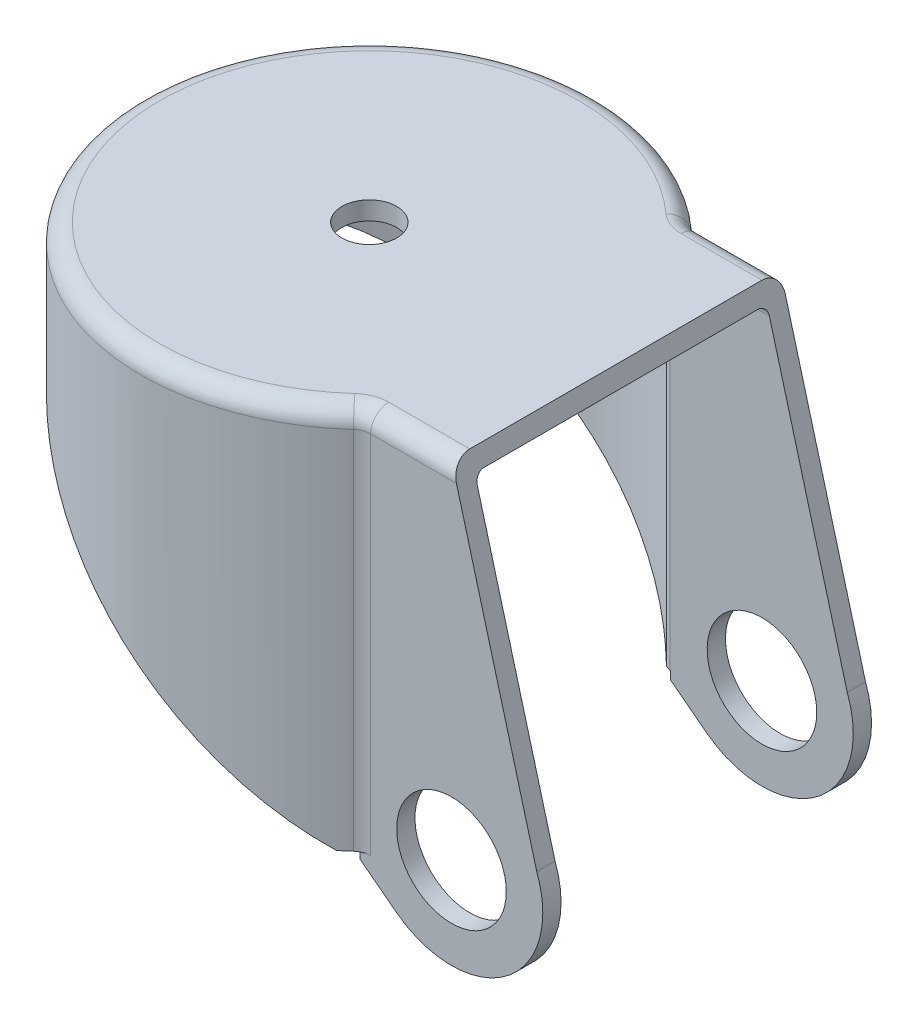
ISO-10303-21;
HEADER;
FILE_DESCRIPTION(('STEP AP214'),'2;1');
FILE_NAME('part.step','',(''),(''),'','','');
FILE_SCHEMA(('AUTOMOTIVE_DESIGN { 1 0 10303 214 1 1 1 1 }'));
ENDSEC;
DATA;
#1=APPLICATION_CONTEXT('core data for automotive mechanical design processes');
#2=APPLICATION_PROTOCOL_DEFINITION('international standard','automotive_design',2000,#1);
#3=PRODUCT_CONTEXT('',#1,'mechanical');
#4=PRODUCT('Part','Part','',(#3));
#5=PRODUCT_RELATED_PRODUCT_CATEGORY('part','',(#4));
#6=PRODUCT_DEFINITION_FORMATION('','',#4);
#7=PRODUCT_DEFINITION_CONTEXT('part definition',#1,'design');
#8=PRODUCT_DEFINITION('design','',#6,#7);
#9=PRODUCT_DEFINITION_SHAPE('','',#8);
#10=(LENGTH_UNIT() NAMED_UNIT(*) SI_UNIT(.MILLI.,.METRE.));
#11=(NAMED_UNIT(*) PLANE_ANGLE_UNIT() SI_UNIT($,.RADIAN.));
#12=(NAMED_UNIT(*) SI_UNIT($,.STERADIAN.) SOLID_ANGLE_UNIT());
#13=UNCERTAINTY_MEASURE_WITH_UNIT(LENGTH_MEASURE(1.E-05),#10,'distance_accuracy_value','');
#14=(GEOMETRIC_REPRESENTATION_CONTEXT(3) GLOBAL_UNCERTAINTY_ASSIGNED_CONTEXT((#13)) GLOBAL_UNIT_ASSIGNED_CONTEXT((#10,
#11,#12)) REPRESENTATION_CONTEXT('',''));
#15=CARTESIAN_POINT('',(0.,0.,0.));
#16=DIRECTION('',(0.,0.,1.));
#17=DIRECTION('',(1.,0.,0.));
#18=AXIS2_PLACEMENT_3D('',#15,#16,#17);
#19=CARTESIAN_POINT('',(-13.5,-2.,0.));
#20=DIRECTION('',(0.,1.,0.));
#21=DIRECTION('',(0.,0.,1.));
#22=AXIS2_PLACEMENT_3D('',#19,#20,#21);
#23=CYLINDRICAL_SURFACE('',#22,11.5);
#24=CARTESIAN_POINT('',(-13.5,-2.,0.));
#25=DIRECTION('',(0.,1.,0.));
#26=DIRECTION('',(0.,0.,-1.));
#27=AXIS2_PLACEMENT_3D('',#24,#25,#26);
#28=CIRCLE('',#27,11.5);
#29=CARTESIAN_POINT('',(-5.38240187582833,-2.,-8.14583333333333));
#30=VERTEX_POINT('',#29);
#31=CARTESIAN_POINT('',(-5.60694741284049,-2.,-8.3635949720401));
#32=VERTEX_POINT('',#31);
#33=EDGE_CURVE('E414',#30,#32,#28,.T.);
#34=ORIENTED_EDGE('',*,*,#33,.F.);
#35=DIRECTION('',(0.,1.,0.));
#36=VECTOR('',#35,1.);
#37=CARTESIAN_POINT('',(-5.38240187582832,-2.,-8.14583333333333));
#38=LINE('',#37,#36);
#39=CARTESIAN_POINT('',(-5.38240187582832,17.5,-8.14583333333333));
#40=VERTEX_POINT('',#39);
#41=EDGE_CURVE('E338',#30,#40,#38,.T.);
#42=ORIENTED_EDGE('',*,*,#41,.T.);
#43=CARTESIAN_POINT('',(-13.5,17.5,0.));
#44=DIRECTION('',(0.,-1.,0.));
#45=DIRECTION('',(0.,0.,-1.));
#46=AXIS2_PLACEMENT_3D('',#43,#44,#45);
#47=CIRCLE('',#46,11.5);
#48=CARTESIAN_POINT('',(-5.38240187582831,17.5,8.14583333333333));
#49=VERTEX_POINT('',#48);
#50=EDGE_CURVE('E334',#40,#49,#47,.F.);
#51=ORIENTED_EDGE('',*,*,#50,.T.);
#52=DIRECTION('',(0.,1.,0.));
#53=VECTOR('',#52,1.);
#54=CARTESIAN_POINT('',(-5.38240187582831,-2.,8.14583333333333));
#55=LINE('',#54,#53);
#56=CARTESIAN_POINT('',(-5.38240187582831,-2.,8.14583333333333));
#57=VERTEX_POINT('',#56);
#58=EDGE_CURVE('E336',#49,#57,#55,.F.);
#59=ORIENTED_EDGE('',*,*,#58,.T.);
#60=CARTESIAN_POINT('',(-5.60694741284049,-2.,8.36359497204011));
#61=VERTEX_POINT('',#60);
#62=EDGE_CURVE('E413',#61,#57,#28,.T.);
#63=ORIENTED_EDGE('',*,*,#62,.F.);
#64=CARTESIAN_POINT('',(-13.5,4.05655226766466,0.));
#65=DIRECTION('',(-0.608761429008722,-0.793353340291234,0.));
#66=DIRECTION('',(-0.793353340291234,0.608761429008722,0.));
#67=AXIS2_PLACEMENT_3D('',#64,#65,#66);
#68=ELLIPSE('',#67,14.4954327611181,11.5);
#69=EDGE_CURVE('E406',#32,#61,#68,.F.);
#70=ORIENTED_EDGE('',*,*,#69,.F.);
#71=EDGE_LOOP('',(#34,#42,#51,#59,#63,#70));
#72=FACE_BOUND('',#71,.T.);
#73=ADVANCED_FACE('F35',(#72),#23,.F.);
#74=CARTESIAN_POINT('',(-13.5,-2.,0.));
#75=DIRECTION('',(0.,-1.,0.));
#76=DIRECTION('',(0.,0.,-1.));
#77=AXIS2_PLACEMENT_3D('',#74,#75,#76);
#78=PLANE('',#77);
#79=ORIENTED_EDGE('',*,*,#62,.T.);
#80=CARTESIAN_POINT('',(-5.02946282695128,-2.,8.49999999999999));
#81=DIRECTION('',(0.,-1.,0.));
#82=DIRECTION('',(0.,0.,-1.));
#83=AXIS2_PLACEMENT_3D('',#80,#81,#82);
#84=CIRCLE('',#83,0.5);
#85=CARTESIAN_POINT('',(-5.02946282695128,-2.,8.));
#86=VERTEX_POINT('',#85);
#87=EDGE_CURVE('E215',#57,#86,#84,.T.);
#88=ORIENTED_EDGE('',*,*,#87,.T.);
#89=DIRECTION('',(-1.,0.,0.));
#90=VECTOR('',#89,1.);
#91=CARTESIAN_POINT('',(-3.04380714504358,-2.,8.));
#92=LINE('',#91,#90);
#93=CARTESIAN_POINT('',(-5.,-2.,8.));
#94=VERTEX_POINT('',#93);
#95=EDGE_CURVE('E208',#94,#86,#92,.T.);
#96=ORIENTED_EDGE('',*,*,#95,.F.);
#97=DIRECTION('',(0.,0.,-1.));
#98=VECTOR('',#97,1.);
#99=CARTESIAN_POINT('',(-5.,-2.,-9.));
#100=LINE('',#99,#98);
#101=CARTESIAN_POINT('',(-5.,-2.,9.));
#102=VERTEX_POINT('',#101);
#103=EDGE_CURVE('E212',#102,#94,#100,.T.);
#104=ORIENTED_EDGE('',*,*,#103,.F.);
#105=DIRECTION('',(-1.,0.,0.));
#106=VECTOR('',#105,1.);
#107=CARTESIAN_POINT('',(-26.,-2.,9.));
#108=LINE('',#107,#106);
#109=CARTESIAN_POINT('',(-4.43082142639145,-2.,9.));
#110=VERTEX_POINT('',#109);
#111=EDGE_CURVE('E419',#110,#102,#108,.T.);
#112=ORIENTED_EDGE('',*,*,#111,.F.);
#113=CARTESIAN_POINT('',(-4.43082142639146,-2.,9.99999999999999));
#114=DIRECTION('',(0.,-1.,0.));
#115=DIRECTION('',(0.,0.,-1.));
#116=AXIS2_PLACEMENT_3D('',#113,#114,#115);
#117=CIRCLE('',#116,1.);
#118=CARTESIAN_POINT('',(-5.10261243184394,-2.,9.25925925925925));
#119=VERTEX_POINT('',#118);
#120=EDGE_CURVE('E306',#110,#119,#117,.F.);
#121=ORIENTED_EDGE('',*,*,#120,.T.);
#122=CARTESIAN_POINT('',(-13.5,-2.,0.));
#123=DIRECTION('',(0.,-1.,0.));
#124=DIRECTION('',(0.,0.,-1.));
#125=AXIS2_PLACEMENT_3D('',#122,#123,#124);
#126=CIRCLE('',#125,12.5);
#127=CARTESIAN_POINT('',(-5.60694741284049,-2.,9.69276641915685));
#128=VERTEX_POINT('',#127);
#129=EDGE_CURVE('E417',#119,#128,#126,.T.);
#130=ORIENTED_EDGE('',*,*,#129,.T.);
#131=DIRECTION('',(0.,0.,-1.));
#132=VECTOR('',#131,1.);
#133=CARTESIAN_POINT('',(-5.60694741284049,-2.,0.));
#134=LINE('',#133,#132);
#135=EDGE_CURVE('E270',#128,#61,#134,.T.);
#136=ORIENTED_EDGE('',*,*,#135,.T.);
#137=EDGE_LOOP('',(#79,#88,#96,#104,#112,#121,#130,#136));
#138=FACE_BOUND('',#137,.T.);
#139=ADVANCED_FACE('F211',(#138),#78,.T.);
#140=DIRECTION('',(1.,0.,0.));
#141=VECTOR('',#140,1.);
#142=CARTESIAN_POINT('',(-3.04380714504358,-2.,-8.));
#143=LINE('',#142,#141);
#144=CARTESIAN_POINT('',(-5.0294628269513,-2.,-8.));
#145=VERTEX_POINT('',#144);
#146=CARTESIAN_POINT('',(-5.,-2.,-8.));
#147=VERTEX_POINT('',#146);
#148=EDGE_CURVE('E219',#145,#147,#143,.T.);
#149=ORIENTED_EDGE('',*,*,#148,.F.);
#150=CARTESIAN_POINT('',(-5.0294628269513,-2.,-8.5));
#151=DIRECTION('',(0.,-1.,0.));
#152=DIRECTION('',(0.,0.,-1.));
#153=AXIS2_PLACEMENT_3D('',#150,#151,#152);
#154=CIRCLE('',#153,0.5);
#155=EDGE_CURVE('E332',#145,#30,#154,.T.);
#156=ORIENTED_EDGE('',*,*,#155,.T.);
#157=ORIENTED_EDGE('',*,*,#33,.T.);
#158=CARTESIAN_POINT('',(-5.60694741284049,-2.,-9.69276641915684));
#159=VERTEX_POINT('',#158);
#160=EDGE_CURVE('E230',#32,#159,#134,.T.);
#161=ORIENTED_EDGE('',*,*,#160,.T.);
#162=CARTESIAN_POINT('',(-5.10261243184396,-2.,-9.25925925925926));
#163=VERTEX_POINT('',#162);
#164=EDGE_CURVE('E416',#159,#163,#126,.T.);
#165=ORIENTED_EDGE('',*,*,#164,.T.);
#166=CARTESIAN_POINT('',(-4.43082142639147,-2.,-10.));
#167=DIRECTION('',(0.,-1.,0.));
#168=DIRECTION('',(0.,0.,-1.));
#169=AXIS2_PLACEMENT_3D('',#166,#167,#168);
#170=CIRCLE('',#169,1.);
#171=CARTESIAN_POINT('',(-4.43082142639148,-2.,-9.));
#172=VERTEX_POINT('',#171);
#173=EDGE_CURVE('E303',#163,#172,#170,.F.);
#174=ORIENTED_EDGE('',*,*,#173,.T.);
#175=DIRECTION('',(1.,0.,0.));
#176=VECTOR('',#175,1.);
#177=CARTESIAN_POINT('',(-26.,-2.,-9.));
#178=LINE('',#177,#176);
#179=CARTESIAN_POINT('',(-5.,-2.,-9.));
#180=VERTEX_POINT('',#179);
#181=EDGE_CURVE('E422',#180,#172,#178,.T.);
#182=ORIENTED_EDGE('',*,*,#181,.F.);
#183=DIRECTION('',(0.,0.,-1.));
#184=VECTOR('',#183,1.);
#185=CARTESIAN_POINT('',(-5.,-2.,-9.));
#186=LINE('',#185,#184);
#187=EDGE_CURVE('E405',#147,#180,#186,.T.);
#188=ORIENTED_EDGE('',*,*,#187,.F.);
#189=EDGE_LOOP('',(#149,#156,#157,#161,#165,#174,#182,#188));
#190=FACE_BOUND('',#189,.T.);
#191=ADVANCED_FACE('F402',(#190),#78,.T.);
#192=CARTESIAN_POINT('',(-13.5,-5.,0.));
#193=DIRECTION('',(0.,1.,0.));
#194=DIRECTION('',(0.,0.,1.));
#195=AXIS2_PLACEMENT_3D('',#192,#193,#194);
#196=CYLINDRICAL_SURFACE('',#195,12.5);
#197=CARTESIAN_POINT('',(-13.5,18.,0.));
#198=DIRECTION('',(0.,-1.,0.));
#199=DIRECTION('',(0.,0.,-1.));
#200=AXIS2_PLACEMENT_3D('',#197,#198,#199);
#201=CIRCLE('',#200,12.5);
#202=CARTESIAN_POINT('',(-5.10261243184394,18.,9.25925925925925));
#203=VERTEX_POINT('',#202);
#204=CARTESIAN_POINT('',(-5.10261243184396,18.,-9.25925925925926));
#205=VERTEX_POINT('',#204);
#206=EDGE_CURVE('E299',#203,#205,#201,.T.);
#207=ORIENTED_EDGE('',*,*,#206,.T.);
#208=DIRECTION('',(0.,1.,0.));
#209=VECTOR('',#208,1.);
#210=CARTESIAN_POINT('',(-5.10261243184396,-5.,-9.25925925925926));
#211=LINE('',#210,#209);
#212=EDGE_CURVE('E301',#205,#163,#211,.F.);
#213=ORIENTED_EDGE('',*,*,#212,.T.);
#214=ORIENTED_EDGE('',*,*,#164,.F.);
#215=CARTESIAN_POINT('',(-13.5,4.05655226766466,0.));
#216=DIRECTION('',(-0.608761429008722,-0.793353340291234,0.));
#217=DIRECTION('',(-0.793353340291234,0.608761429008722,0.));
#218=AXIS2_PLACEMENT_3D('',#215,#216,#217);
#219=ELLIPSE('',#218,15.7559051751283,12.5);
#220=EDGE_CURVE('E408',#128,#159,#219,.T.);
#221=ORIENTED_EDGE('',*,*,#220,.F.);
#222=ORIENTED_EDGE('',*,*,#129,.F.);
#223=DIRECTION('',(0.,1.,0.));
#224=VECTOR('',#223,1.);
#225=CARTESIAN_POINT('',(-5.10261243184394,-5.,9.25925925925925));
#226=LINE('',#225,#224);
#227=EDGE_CURVE('E297',#119,#203,#226,.T.);
#228=ORIENTED_EDGE('',*,*,#227,.T.);
#229=EDGE_LOOP('',(#207,#213,#214,#221,#222,#228));
#230=FACE_BOUND('',#229,.T.);
#231=ADVANCED_FACE('F489',(#230),#196,.T.);
#232=CARTESIAN_POINT('',(-26.,18.,9.));
#233=DIRECTION('',(0.,-1.,0.));
#234=DIRECTION('',(0.,0.,-1.));
#235=AXIS2_PLACEMENT_3D('',#232,#233,#234);
#236=PLANE('',#235);
#237=DIRECTION('',(0.,0.,-1.));
#238=VECTOR('',#237,1.);
#239=CARTESIAN_POINT('',(0.27130076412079,18.,9.));
#240=LINE('',#239,#238);
#241=CARTESIAN_POINT('',(0.27130076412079,18.,7.5));
#242=VERTEX_POINT('',#241);
#243=CARTESIAN_POINT('',(0.271300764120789,18.,-7.49999999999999));
#244=VERTEX_POINT('',#243);
#245=EDGE_CURVE('E252',#242,#244,#240,.T.);
#246=ORIENTED_EDGE('',*,*,#245,.F.);
#247=DIRECTION('',(1.,0.,0.));
#248=VECTOR('',#247,1.);
#249=CARTESIAN_POINT('',(-5.23864417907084,18.,7.5));
#250=LINE('',#249,#248);
#251=CARTESIAN_POINT('',(-5.02946282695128,18.,7.5));
#252=VERTEX_POINT('',#251);
#253=EDGE_CURVE('E52',#242,#252,#250,.F.);
#254=ORIENTED_EDGE('',*,*,#253,.T.);
#255=CARTESIAN_POINT('',(-5.02946282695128,18.,8.49999999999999));
#256=DIRECTION('',(0.,-1.,0.));
#257=DIRECTION('',(0.,0.,-1.));
#258=AXIS2_PLACEMENT_3D('',#255,#256,#257);
#259=CIRCLE('',#258,1.);
#260=CARTESIAN_POINT('',(-5.73534092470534,18.,7.79166666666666));
#261=VERTEX_POINT('',#260);
#262=EDGE_CURVE('E57',#261,#252,#259,.T.);
#263=ORIENTED_EDGE('',*,*,#262,.F.);
#264=CARTESIAN_POINT('',(-13.5,18.,0.));
#265=DIRECTION('',(0.,-1.,0.));
#266=DIRECTION('',(0.,0.,-1.));
#267=AXIS2_PLACEMENT_3D('',#264,#265,#266);
#268=CIRCLE('',#267,11.);
#269=CARTESIAN_POINT('',(-5.73534092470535,18.,-7.79166666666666));
#270=VERTEX_POINT('',#269);
#271=EDGE_CURVE('E348',#261,#270,#268,.T.);
#272=ORIENTED_EDGE('',*,*,#271,.T.);
#273=CARTESIAN_POINT('',(-5.0294628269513,18.,-8.5));
#274=DIRECTION('',(0.,-1.,0.));
#275=DIRECTION('',(0.,0.,-1.));
#276=AXIS2_PLACEMENT_3D('',#273,#274,#275);
#277=CIRCLE('',#276,1.);
#278=CARTESIAN_POINT('',(-5.0294628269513,18.,-7.5));
#279=VERTEX_POINT('',#278);
#280=EDGE_CURVE('E345',#279,#270,#277,.T.);
#281=ORIENTED_EDGE('',*,*,#280,.F.);
#282=DIRECTION('',(1.,0.,0.));
#283=VECTOR('',#282,1.);
#284=CARTESIAN_POINT('',(0.27130076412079,18.,-7.5));
#285=LINE('',#284,#283);
#286=EDGE_CURVE('E350',#279,#244,#285,.T.);
#287=ORIENTED_EDGE('',*,*,#286,.T.);
#288=EDGE_LOOP('',(#246,#254,#263,#272,#281,#287));
#289=FACE_BOUND('',#288,.T.);
#290=CARTESIAN_POINT('',(-13.5,18.,0.));
#291=DIRECTION('',(0.,-1.,0.));
#292=DIRECTION('',(0.,0.,-1.));
#293=AXIS2_PLACEMENT_3D('',#290,#291,#292);
#294=CIRCLE('',#293,1.5);
#295=CARTESIAN_POINT('',(-13.5,18.,1.50000000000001));
#296=VERTEX_POINT('',#295);
#297=EDGE_CURVE('E220',#296,#296,#294,.T.);
#298=ORIENTED_EDGE('',*,*,#297,.F.);
#299=EDGE_LOOP('',(#298));
#300=FACE_BOUND('',#299,.T.);
#301=ADVANCED_FACE('F379',(#289,#300),#236,.T.);
#302=CARTESIAN_POINT('',(-26.,19.,-8.));
#303=DIRECTION('',(0.,0.,1.));
#304=DIRECTION('',(0.,-1.,0.));
#305=AXIS2_PLACEMENT_3D('',#302,#303,#304);
#306=PLANE('',#305);
#307=DIRECTION('',(1.,0.,0.));
#308=VECTOR('',#307,1.);
#309=CARTESIAN_POINT('',(-5.23864417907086,17.5,-8.));
#310=LINE('',#309,#308);
#311=CARTESIAN_POINT('',(0.406951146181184,17.5,-8.));
#312=VERTEX_POINT('',#311);
#313=CARTESIAN_POINT('',(-5.0294628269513,17.5,-8.));
#314=VERTEX_POINT('',#313);
#315=EDGE_CURVE('E308',#312,#314,#310,.F.);
#316=ORIENTED_EDGE('',*,*,#315,.T.);
#317=DIRECTION('',(0.,-1.,0.));
#318=VECTOR('',#317,1.);
#319=CARTESIAN_POINT('',(-5.0294628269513,-2.,-8.));
#320=LINE('',#319,#318);
#321=EDGE_CURVE('E329',#314,#145,#320,.T.);
#322=ORIENTED_EDGE('',*,*,#321,.T.);
#323=ORIENTED_EDGE('',*,*,#148,.T.);
#324=DIRECTION('',(0.,1.,0.));
#325=VECTOR('',#324,1.);
#326=CARTESIAN_POINT('',(-5.,19.,-8.));
#327=LINE('',#326,#325);
#328=CARTESIAN_POINT('',(-5.,-2.46572713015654,-8.));
#329=VERTEX_POINT('',#328);
#330=EDGE_CURVE('E238',#329,#147,#327,.T.);
#331=ORIENTED_EDGE('',*,*,#330,.F.);
#332=DIRECTION('',(-0.793353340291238,0.608761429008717,0.));
#333=VECTOR('',#332,1.);
#334=CARTESIAN_POINT('',(-28.5847500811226,15.6314881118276,-8.));
#335=LINE('',#334,#333);
#336=CARTESIAN_POINT('',(-3.04380714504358,-3.96676670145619,-8.));
#337=VERTEX_POINT('',#336);
#338=EDGE_CURVE('E239',#337,#329,#335,.T.);
#339=ORIENTED_EDGE('',*,*,#338,.F.);
#340=CARTESIAN_POINT('',(0.,0.,-8.));
#341=DIRECTION('',(0.,0.,1.));
#342=DIRECTION('',(0.,-1.,0.));
#343=AXIS2_PLACEMENT_3D('',#340,#341,#342);
#344=CIRCLE('',#343,5.);
#345=CARTESIAN_POINT('',(4.67024886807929,1.78571428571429,-8.));
#346=VERTEX_POINT('',#345);
#347=EDGE_CURVE('E454',#346,#337,#344,.F.);
#348=ORIENTED_EDGE('',*,*,#347,.F.);
#349=DIRECTION('',(0.261835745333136,-0.965112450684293,0.));
#350=VECTOR('',#349,1.);
#351=CARTESIAN_POINT('',(-1.78250689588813,25.5702243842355,-8.));
#352=LINE('',#351,#350);
#353=EDGE_CURVE('E255',#312,#346,#352,.T.);
#354=ORIENTED_EDGE('',*,*,#353,.F.);
#355=EDGE_LOOP('',(#316,#322,#323,#331,#339,#348,#354));
#356=FACE_BOUND('',#355,.T.);
#357=CARTESIAN_POINT('',(0.,0.,-8.));
#358=DIRECTION('',(0.,0.,1.));
#359=DIRECTION('',(0.,-1.,0.));
#360=AXIS2_PLACEMENT_3D('',#357,#358,#359);
#361=CIRCLE('',#360,3.);
#362=CARTESIAN_POINT('',(0.,-3.,-8.));
#363=VERTEX_POINT('',#362);
#364=EDGE_CURVE('E231',#363,#363,#361,.T.);
#365=ORIENTED_EDGE('',*,*,#364,.F.);
#366=EDGE_LOOP('',(#365));
#367=FACE_BOUND('',#366,.T.);
#368=ADVANCED_FACE('F396',(#356,#367),#306,.T.);
#369=CARTESIAN_POINT('',(-26.,-5.,8.));
#370=DIRECTION('',(0.,0.,-1.));
#371=DIRECTION('',(0.,1.,0.));
#372=AXIS2_PLACEMENT_3D('',#369,#370,#371);
#373=PLANE('',#372);
#374=ORIENTED_EDGE('',*,*,#95,.T.);
#375=DIRECTION('',(0.,-1.,0.));
#376=VECTOR('',#375,1.);
#377=CARTESIAN_POINT('',(-5.02946282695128,18.,8.));
#378=LINE('',#377,#376);
#379=CARTESIAN_POINT('',(-5.02946282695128,17.5,8.));
#380=VERTEX_POINT('',#379);
#381=EDGE_CURVE('E342',#86,#380,#378,.F.);
#382=ORIENTED_EDGE('',*,*,#381,.T.);
#383=DIRECTION('',(1.,0.,0.));
#384=VECTOR('',#383,1.);
#385=CARTESIAN_POINT('',(0.2713007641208,17.5,8.));
#386=LINE('',#385,#384);
#387=CARTESIAN_POINT('',(0.406951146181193,17.5,8.));
#388=VERTEX_POINT('',#387);
#389=EDGE_CURVE('E340',#380,#388,#386,.T.);
#390=ORIENTED_EDGE('',*,*,#389,.T.);
#391=DIRECTION('',(-0.261835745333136,0.965112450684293,0.));
#392=VECTOR('',#391,1.);
#393=CARTESIAN_POINT('',(4.28231561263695,3.2156153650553,8.));
#394=LINE('',#393,#392);
#395=CARTESIAN_POINT('',(4.67024886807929,1.78571428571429,8.));
#396=VERTEX_POINT('',#395);
#397=EDGE_CURVE('E249',#396,#388,#394,.T.);
#398=ORIENTED_EDGE('',*,*,#397,.F.);
#399=CARTESIAN_POINT('',(0.,0.,7.99999999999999));
#400=DIRECTION('',(0.,0.,-1.));
#401=DIRECTION('',(0.,1.,0.));
#402=AXIS2_PLACEMENT_3D('',#399,#400,#401);
#403=CIRCLE('',#402,5.);
#404=CARTESIAN_POINT('',(-3.04380714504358,-3.96676670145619,7.99999999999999));
#405=VERTEX_POINT('',#404);
#406=EDGE_CURVE('E445',#405,#396,#403,.F.);
#407=ORIENTED_EDGE('',*,*,#406,.F.);
#408=DIRECTION('',(0.793353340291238,-0.608761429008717,0.));
#409=VECTOR('',#408,1.);
#410=CARTESIAN_POINT('',(-16.9936401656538,6.73731665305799,8.));
#411=LINE('',#410,#409);
#412=CARTESIAN_POINT('',(-5.,-2.46572713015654,7.99999999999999));
#413=VERTEX_POINT('',#412);
#414=EDGE_CURVE('E237',#413,#405,#411,.T.);
#415=ORIENTED_EDGE('',*,*,#414,.F.);
#416=DIRECTION('',(0.,-1.,0.));
#417=VECTOR('',#416,1.);
#418=CARTESIAN_POINT('',(-5.,-5.,8.));
#419=LINE('',#418,#417);
#420=EDGE_CURVE('E226',#94,#413,#419,.T.);
#421=ORIENTED_EDGE('',*,*,#420,.F.);
#422=EDGE_LOOP('',(#374,#382,#390,#398,#407,#415,#421));
#423=FACE_BOUND('',#422,.T.);
#424=CARTESIAN_POINT('',(0.,0.,7.99999999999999));
#425=DIRECTION('',(0.,0.,-1.));
#426=DIRECTION('',(0.,1.,0.));
#427=AXIS2_PLACEMENT_3D('',#424,#425,#426);
#428=CIRCLE('',#427,3.);
#429=CARTESIAN_POINT('',(0.,3.,7.99999999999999));
#430=VERTEX_POINT('',#429);
#431=EDGE_CURVE('E261',#430,#430,#428,.T.);
#432=ORIENTED_EDGE('',*,*,#431,.F.);
#433=EDGE_LOOP('',(#432));
#434=FACE_BOUND('',#433,.T.);
#435=ADVANCED_FACE('F234',(#423,#434),#373,.T.);
#436=CARTESIAN_POINT('',(-26.,-5.,9.));
#437=DIRECTION('',(0.,0.,-1.));
#438=DIRECTION('',(0.,1.,0.));
#439=AXIS2_PLACEMENT_3D('',#436,#437,#438);
#440=PLANE('',#439);
#441=CARTESIAN_POINT('',(0.,0.,9.));
#442=DIRECTION('',(0.,0.,1.));
#443=DIRECTION('',(1.,0.,0.));
#444=AXIS2_PLACEMENT_3D('',#441,#442,#443);
#445=CIRCLE('',#444,3.);
#446=CARTESIAN_POINT('',(3.,0.,9.));
#447=VERTEX_POINT('',#446);
#448=EDGE_CURVE('E257',#447,#447,#445,.T.);
#449=ORIENTED_EDGE('',*,*,#448,.F.);
#450=EDGE_LOOP('',(#449));
#451=FACE_BOUND('',#450,.T.);
#452=DIRECTION('',(0.261835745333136,-0.965112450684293,0.));
#453=VECTOR('',#452,1.);
#454=CARTESIAN_POINT('',(4.67024886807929,1.78571428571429,9.));
#455=LINE('',#454,#453);
#456=CARTESIAN_POINT('',(0.271300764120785,18.,9.));
#457=VERTEX_POINT('',#456);
#458=CARTESIAN_POINT('',(4.67024886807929,1.78571428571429,9.));
#459=VERTEX_POINT('',#458);
#460=EDGE_CURVE('E428',#457,#459,#455,.T.);
#461=ORIENTED_EDGE('',*,*,#460,.F.);
#462=DIRECTION('',(1.,0.,0.));
#463=VECTOR('',#462,1.);
#464=CARTESIAN_POINT('',(-26.,18.,9.));
#465=LINE('',#464,#463);
#466=CARTESIAN_POINT('',(-4.43082142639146,18.,9.));
#467=VERTEX_POINT('',#466);
#468=EDGE_CURVE('E291',#457,#467,#465,.F.);
#469=ORIENTED_EDGE('',*,*,#468,.T.);
#470=DIRECTION('',(0.,-1.,0.));
#471=VECTOR('',#470,1.);
#472=CARTESIAN_POINT('',(-4.43082142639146,-2.,9.));
#473=LINE('',#472,#471);
#474=EDGE_CURVE('E288',#467,#110,#473,.T.);
#475=ORIENTED_EDGE('',*,*,#474,.T.);
#476=ORIENTED_EDGE('',*,*,#111,.T.);
#477=DIRECTION('',(0.,1.,0.));
#478=VECTOR('',#477,1.);
#479=CARTESIAN_POINT('',(-5.,-2.46572713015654,9.));
#480=LINE('',#479,#478);
#481=CARTESIAN_POINT('',(-5.,-2.46572713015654,9.));
#482=VERTEX_POINT('',#481);
#483=EDGE_CURVE('E229',#482,#102,#480,.T.);
#484=ORIENTED_EDGE('',*,*,#483,.F.);
#485=DIRECTION('',(-0.793353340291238,0.608761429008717,0.));
#486=VECTOR('',#485,1.);
#487=CARTESIAN_POINT('',(-3.04380714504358,-3.96676670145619,9.));
#488=LINE('',#487,#486);
#489=CARTESIAN_POINT('',(-3.04380714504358,-3.96676670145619,9.));
#490=VERTEX_POINT('',#489);
#491=EDGE_CURVE('E438',#490,#482,#488,.T.);
#492=ORIENTED_EDGE('',*,*,#491,.F.);
#493=CARTESIAN_POINT('',(0.,0.,9.));
#494=DIRECTION('',(0.,0.,-1.));
#495=DIRECTION('',(1.,0.,0.));
#496=AXIS2_PLACEMENT_3D('',#493,#494,#495);
#497=CIRCLE('',#496,5.);
#498=EDGE_CURVE('E424',#459,#490,#497,.T.);
#499=ORIENTED_EDGE('',*,*,#498,.F.);
#500=EDGE_LOOP('',(#461,#469,#475,#476,#484,#492,#499));
#501=FACE_BOUND('',#500,.T.);
#502=ADVANCED_FACE('F515',(#451,#501),#440,.F.);
#503=CARTESIAN_POINT('',(-26.,19.,-9.));
#504=DIRECTION('',(0.,0.,1.));
#505=DIRECTION('',(0.,-1.,0.));
#506=AXIS2_PLACEMENT_3D('',#503,#504,#505);
#507=PLANE('',#506);
#508=CARTESIAN_POINT('',(0.,0.,-9.));
#509=DIRECTION('',(0.,0.,1.));
#510=DIRECTION('',(1.,0.,0.));
#511=AXIS2_PLACEMENT_3D('',#508,#509,#510);
#512=CIRCLE('',#511,3.);
#513=CARTESIAN_POINT('',(3.,0.,-9.));
#514=VERTEX_POINT('',#513);
#515=EDGE_CURVE('E258',#514,#514,#512,.T.);
#516=ORIENTED_EDGE('',*,*,#515,.T.);
#517=EDGE_LOOP('',(#516));
#518=FACE_BOUND('',#517,.T.);
#519=DIRECTION('',(0.,-1.,0.));
#520=VECTOR('',#519,1.);
#521=CARTESIAN_POINT('',(-4.43082142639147,19.,-9.));
#522=LINE('',#521,#520);
#523=CARTESIAN_POINT('',(-4.43082142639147,18.,-9.));
#524=VERTEX_POINT('',#523);
#525=EDGE_CURVE('E293',#172,#524,#522,.F.);
#526=ORIENTED_EDGE('',*,*,#525,.T.);
#527=DIRECTION('',(1.,0.,0.));
#528=VECTOR('',#527,1.);
#529=CARTESIAN_POINT('',(-26.,18.,-9.));
#530=LINE('',#529,#528);
#531=CARTESIAN_POINT('',(0.271300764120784,18.,-9.));
#532=VERTEX_POINT('',#531);
#533=EDGE_CURVE('E295',#524,#532,#530,.T.);
#534=ORIENTED_EDGE('',*,*,#533,.T.);
#535=DIRECTION('',(0.261835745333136,-0.965112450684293,0.));
#536=VECTOR('',#535,1.);
#537=CARTESIAN_POINT('',(4.67024886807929,1.78571428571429,-9.));
#538=LINE('',#537,#536);
#539=CARTESIAN_POINT('',(4.67024886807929,1.78571428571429,-9.));
#540=VERTEX_POINT('',#539);
#541=EDGE_CURVE('E433',#532,#540,#538,.T.);
#542=ORIENTED_EDGE('',*,*,#541,.T.);
#543=CARTESIAN_POINT('',(0.,0.,-9.));
#544=DIRECTION('',(0.,0.,-1.));
#545=DIRECTION('',(1.,0.,0.));
#546=AXIS2_PLACEMENT_3D('',#543,#544,#545);
#547=CIRCLE('',#546,5.);
#548=CARTESIAN_POINT('',(-3.04380714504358,-3.96676670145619,-9.));
#549=VERTEX_POINT('',#548);
#550=EDGE_CURVE('E425',#540,#549,#547,.T.);
#551=ORIENTED_EDGE('',*,*,#550,.T.);
#552=DIRECTION('',(-0.793353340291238,0.608761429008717,0.));
#553=VECTOR('',#552,1.);
#554=CARTESIAN_POINT('',(-3.04380714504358,-3.96676670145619,-9.));
#555=LINE('',#554,#553);
#556=CARTESIAN_POINT('',(-5.,-2.46572713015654,-9.));
#557=VERTEX_POINT('',#556);
#558=EDGE_CURVE('E427',#549,#557,#555,.T.);
#559=ORIENTED_EDGE('',*,*,#558,.T.);
#560=DIRECTION('',(0.,1.,0.));
#561=VECTOR('',#560,1.);
#562=CARTESIAN_POINT('',(-5.,-2.46572713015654,-9.));
#563=LINE('',#562,#561);
#564=EDGE_CURVE('E430',#557,#180,#563,.T.);
#565=ORIENTED_EDGE('',*,*,#564,.T.);
#566=ORIENTED_EDGE('',*,*,#181,.T.);
#567=EDGE_LOOP('',(#526,#534,#542,#551,#559,#565,#566));
#568=FACE_BOUND('',#567,.T.);
#569=ADVANCED_FACE('F518',(#518,#568),#507,.F.);
#570=CARTESIAN_POINT('',(-26.,19.,9.));
#571=DIRECTION('',(0.,-1.,0.));
#572=DIRECTION('',(0.,0.,-1.));
#573=AXIS2_PLACEMENT_3D('',#570,#571,#572);
#574=PLANE('',#573);
#575=CARTESIAN_POINT('',(-13.5,19.,0.));
#576=DIRECTION('',(0.,1.,0.));
#577=DIRECTION('',(0.,0.,1.));
#578=AXIS2_PLACEMENT_3D('',#575,#576,#577);
#579=CIRCLE('',#578,1.5);
#580=CARTESIAN_POINT('',(-13.5,19.,1.50000000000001));
#581=VERTEX_POINT('',#580);
#582=EDGE_CURVE('E327',#581,#581,#579,.T.);
#583=ORIENTED_EDGE('',*,*,#582,.F.);
#584=EDGE_LOOP('',(#583));
#585=FACE_BOUND('',#584,.T.);
#586=CARTESIAN_POINT('',(-4.43082142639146,19.,9.99999999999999));
#587=DIRECTION('',(0.,-1.,0.));
#588=DIRECTION('',(0.,0.,-1.));
#589=AXIS2_PLACEMENT_3D('',#586,#587,#588);
#590=CIRCLE('',#589,2.);
#591=CARTESIAN_POINT('',(-4.43082142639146,19.,8.));
#592=VERTEX_POINT('',#591);
#593=CARTESIAN_POINT('',(-5.77440343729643,19.,8.51851851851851));
#594=VERTEX_POINT('',#593);
#595=EDGE_CURVE('E271',#592,#594,#590,.F.);
#596=ORIENTED_EDGE('',*,*,#595,.F.);
#597=DIRECTION('',(1.,0.,0.));
#598=VECTOR('',#597,1.);
#599=CARTESIAN_POINT('',(-26.,19.,8.));
#600=LINE('',#599,#598);
#601=CARTESIAN_POINT('',(0.,19.,8.));
#602=VERTEX_POINT('',#601);
#603=EDGE_CURVE('E281',#592,#602,#600,.T.);
#604=ORIENTED_EDGE('',*,*,#603,.T.);
#605=DIRECTION('',(0.,0.,-1.));
#606=VECTOR('',#605,1.);
#607=CARTESIAN_POINT('',(0.,19.,9.));
#608=LINE('',#607,#606);
#609=CARTESIAN_POINT('',(0.,19.,-7.99999999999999));
#610=VERTEX_POINT('',#609);
#611=EDGE_CURVE('E242',#602,#610,#608,.T.);
#612=ORIENTED_EDGE('',*,*,#611,.T.);
#613=DIRECTION('',(1.,0.,0.));
#614=VECTOR('',#613,1.);
#615=CARTESIAN_POINT('',(-26.,19.,-8.));
#616=LINE('',#615,#614);
#617=CARTESIAN_POINT('',(-4.43082142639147,19.,-8.));
#618=VERTEX_POINT('',#617);
#619=EDGE_CURVE('E279',#610,#618,#616,.F.);
#620=ORIENTED_EDGE('',*,*,#619,.T.);
#621=CARTESIAN_POINT('',(-4.43082142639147,19.,-10.));
#622=DIRECTION('',(0.,-1.,0.));
#623=DIRECTION('',(0.,0.,-1.));
#624=AXIS2_PLACEMENT_3D('',#621,#622,#623);
#625=CIRCLE('',#624,2.);
#626=CARTESIAN_POINT('',(-5.77440343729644,19.,-8.51851851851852));
#627=VERTEX_POINT('',#626);
#628=EDGE_CURVE('E276',#627,#618,#625,.F.);
#629=ORIENTED_EDGE('',*,*,#628,.F.);
#630=CARTESIAN_POINT('',(-13.5,19.,0.));
#631=DIRECTION('',(0.,-1.,0.));
#632=DIRECTION('',(0.,0.,-1.));
#633=AXIS2_PLACEMENT_3D('',#630,#631,#632);
#634=CIRCLE('',#633,11.5);
#635=EDGE_CURVE('E274',#627,#594,#634,.F.);
#636=ORIENTED_EDGE('',*,*,#635,.T.);
#637=EDGE_LOOP('',(#596,#604,#612,#620,#629,#636));
#638=FACE_BOUND('',#637,.T.);
#639=ADVANCED_FACE('F520',(#585,#638),#574,.F.);
#640=CARTESIAN_POINT('',(0.,0.,-9.));
#641=DIRECTION('',(0.,0.,1.));
#642=DIRECTION('',(1.,0.,0.));
#643=AXIS2_PLACEMENT_3D('',#640,#641,#642);
#644=CYLINDRICAL_SURFACE('',#643,3.);
#645=ORIENTED_EDGE('',*,*,#364,.T.);
#646=EDGE_LOOP('',(#645));
#647=FACE_BOUND('',#646,.T.);
#648=ORIENTED_EDGE('',*,*,#515,.F.);
#649=EDGE_LOOP('',(#648));
#650=FACE_BOUND('',#649,.T.);
#651=ADVANCED_FACE('F509',(#647,#650),#644,.F.);
#652=ORIENTED_EDGE('',*,*,#431,.T.);
#653=EDGE_LOOP('',(#652));
#654=FACE_BOUND('',#653,.T.);
#655=ORIENTED_EDGE('',*,*,#448,.T.);
#656=EDGE_LOOP('',(#655));
#657=FACE_BOUND('',#656,.T.);
#658=ADVANCED_FACE('F496',(#654,#657),#644,.F.);
#659=CARTESIAN_POINT('',(4.67024886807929,1.78571428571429,-9.));
#660=DIRECTION('',(-0.965112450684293,-0.261835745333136,0.));
#661=DIRECTION('',(0.261835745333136,-0.965112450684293,0.));
#662=AXIS2_PLACEMENT_3D('',#659,#660,#661);
#663=PLANE('',#662);
#664=ORIENTED_EDGE('',*,*,#611,.F.);
#665=CARTESIAN_POINT('',(0.27130076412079,18.,8.));
#666=DIRECTION('',(-0.965112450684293,-0.261835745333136,0.));
#667=DIRECTION('',(0.261835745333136,-0.965112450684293,0.));
#668=AXIS2_PLACEMENT_3D('',#665,#666,#667);
#669=ELLIPSE('',#668,1.03614868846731,1.);
#670=EDGE_CURVE('E286',#602,#457,#669,.F.);
#671=ORIENTED_EDGE('',*,*,#670,.T.);
#672=ORIENTED_EDGE('',*,*,#460,.T.);
#673=DIRECTION('',(0.,0.,1.));
#674=VECTOR('',#673,1.);
#675=CARTESIAN_POINT('',(4.67024886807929,1.78571428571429,-9.));
#676=LINE('',#675,#674);
#677=EDGE_CURVE('E446',#396,#459,#676,.T.);
#678=ORIENTED_EDGE('',*,*,#677,.F.);
#679=ORIENTED_EDGE('',*,*,#397,.T.);
#680=CARTESIAN_POINT('',(0.406951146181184,17.5,7.5));
#681=DIRECTION('',(-0.965112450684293,-0.261835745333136,0.));
#682=DIRECTION('',(-0.261835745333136,0.965112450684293,0.));
#683=AXIS2_PLACEMENT_3D('',#680,#681,#682);
#684=ELLIPSE('',#683,0.518074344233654,0.5);
#685=EDGE_CURVE('E44',#388,#242,#684,.T.);
#686=ORIENTED_EDGE('',*,*,#685,.T.);
#687=ORIENTED_EDGE('',*,*,#245,.T.);
#688=CARTESIAN_POINT('',(0.406951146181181,17.5,-7.5));
#689=DIRECTION('',(-0.965112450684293,-0.261835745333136,0.));
#690=DIRECTION('',(-0.261835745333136,0.965112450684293,0.));
#691=AXIS2_PLACEMENT_3D('',#688,#689,#690);
#692=ELLIPSE('',#691,0.518074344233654,0.5);
#693=EDGE_CURVE('E11',#244,#312,#692,.T.);
#694=ORIENTED_EDGE('',*,*,#693,.T.);
#695=ORIENTED_EDGE('',*,*,#353,.T.);
#696=EDGE_CURVE('E442',#540,#346,#676,.T.);
#697=ORIENTED_EDGE('',*,*,#696,.F.);
#698=ORIENTED_EDGE('',*,*,#541,.F.);
#699=CARTESIAN_POINT('',(0.27130076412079,18.,-8.));
#700=DIRECTION('',(-0.965112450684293,-0.261835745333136,0.));
#701=DIRECTION('',(0.261835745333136,-0.965112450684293,0.));
#702=AXIS2_PLACEMENT_3D('',#699,#700,#701);
#703=ELLIPSE('',#702,1.03614868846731,1.);
#704=EDGE_CURVE('E284',#532,#610,#703,.F.);
#705=ORIENTED_EDGE('',*,*,#704,.T.);
#706=EDGE_LOOP('',(#664,#671,#672,#678,#679,#686,#687,#694,#695,#697,#698,#705));
#707=FACE_BOUND('',#706,.T.);
#708=ADVANCED_FACE('F470',(#707),#663,.F.);
#709=CARTESIAN_POINT('',(-5.,-2.46572713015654,-9.));
#710=DIRECTION('',(1.,0.,0.));
#711=DIRECTION('',(0.,0.,-1.));
#712=AXIS2_PLACEMENT_3D('',#709,#710,#711);
#713=PLANE('',#712);
#714=ORIENTED_EDGE('',*,*,#330,.T.);
#715=ORIENTED_EDGE('',*,*,#187,.T.);
#716=ORIENTED_EDGE('',*,*,#564,.F.);
#717=DIRECTION('',(0.,0.,1.));
#718=VECTOR('',#717,1.);
#719=CARTESIAN_POINT('',(-5.,-2.46572713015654,-9.));
#720=LINE('',#719,#718);
#721=EDGE_CURVE('E447',#557,#329,#720,.T.);
#722=ORIENTED_EDGE('',*,*,#721,.T.);
#723=EDGE_LOOP('',(#714,#715,#716,#722));
#724=FACE_BOUND('',#723,.T.);
#725=ADVANCED_FACE('F495',(#724),#713,.F.);
#726=CARTESIAN_POINT('',(-3.04380714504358,-3.96676670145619,-9.));
#727=DIRECTION('',(0.608761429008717,0.793353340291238,0.));
#728=DIRECTION('',(-0.793353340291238,0.608761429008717,0.));
#729=AXIS2_PLACEMENT_3D('',#726,#727,#728);
#730=PLANE('',#729);
#731=ORIENTED_EDGE('',*,*,#338,.T.);
#732=ORIENTED_EDGE('',*,*,#721,.F.);
#733=ORIENTED_EDGE('',*,*,#558,.F.);
#734=DIRECTION('',(0.,0.,1.));
#735=VECTOR('',#734,1.);
#736=CARTESIAN_POINT('',(-3.04380714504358,-3.96676670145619,-9.));
#737=LINE('',#736,#735);
#738=EDGE_CURVE('E451',#549,#337,#737,.T.);
#739=ORIENTED_EDGE('',*,*,#738,.T.);
#740=EDGE_LOOP('',(#731,#732,#733,#739));
#741=FACE_BOUND('',#740,.T.);
#742=ADVANCED_FACE('F502',(#741),#730,.F.);
#743=CARTESIAN_POINT('',(0.,0.,-9.));
#744=DIRECTION('',(0.,0.,1.));
#745=DIRECTION('',(1.,0.,0.));
#746=AXIS2_PLACEMENT_3D('',#743,#744,#745);
#747=CYLINDRICAL_SURFACE('',#746,5.);
#748=ORIENTED_EDGE('',*,*,#347,.T.);
#749=ORIENTED_EDGE('',*,*,#738,.F.);
#750=ORIENTED_EDGE('',*,*,#550,.F.);
#751=ORIENTED_EDGE('',*,*,#696,.T.);
#752=EDGE_LOOP('',(#748,#749,#750,#751));
#753=FACE_BOUND('',#752,.T.);
#754=ADVANCED_FACE('F503',(#753),#747,.T.);
#755=ORIENTED_EDGE('',*,*,#406,.T.);
#756=ORIENTED_EDGE('',*,*,#677,.T.);
#757=ORIENTED_EDGE('',*,*,#498,.T.);
#758=EDGE_CURVE('E435',#405,#490,#737,.T.);
#759=ORIENTED_EDGE('',*,*,#758,.F.);
#760=EDGE_LOOP('',(#755,#756,#757,#759));
#761=FACE_BOUND('',#760,.T.);
#762=ADVANCED_FACE('F460',(#761),#747,.T.);
#763=ORIENTED_EDGE('',*,*,#483,.T.);
#764=ORIENTED_EDGE('',*,*,#103,.T.);
#765=ORIENTED_EDGE('',*,*,#420,.T.);
#766=EDGE_CURVE('E450',#413,#482,#720,.T.);
#767=ORIENTED_EDGE('',*,*,#766,.T.);
#768=EDGE_LOOP('',(#763,#764,#765,#767));
#769=FACE_BOUND('',#768,.T.);
#770=ADVANCED_FACE('F224',(#769),#713,.F.);
#771=ORIENTED_EDGE('',*,*,#414,.T.);
#772=ORIENTED_EDGE('',*,*,#758,.T.);
#773=ORIENTED_EDGE('',*,*,#491,.T.);
#774=ORIENTED_EDGE('',*,*,#766,.F.);
#775=EDGE_LOOP('',(#771,#772,#773,#774));
#776=FACE_BOUND('',#775,.T.);
#777=ADVANCED_FACE('F458',(#776),#730,.F.);
#778=CARTESIAN_POINT('',(0.0581863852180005,-6.34701005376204,12.5));
#779=DIRECTION('',(-0.608761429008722,-0.793353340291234,0.));
#780=DIRECTION('',(0.793353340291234,-0.608761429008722,0.));
#781=AXIS2_PLACEMENT_3D('',#778,#779,#780);
#782=PLANE('',#781);
#783=ORIENTED_EDGE('',*,*,#220,.T.);
#784=ORIENTED_EDGE('',*,*,#160,.F.);
#785=ORIENTED_EDGE('',*,*,#69,.T.);
#786=ORIENTED_EDGE('',*,*,#135,.F.);
#787=EDGE_LOOP('',(#783,#784,#785,#786));
#788=FACE_BOUND('',#787,.T.);
#789=ADVANCED_FACE('F501',(#788),#782,.T.);
#790=CARTESIAN_POINT('',(-13.5,-5.,0.));
#791=DIRECTION('',(0.,1.,0.));
#792=DIRECTION('',(0.,0.,1.));
#793=AXIS2_PLACEMENT_3D('',#790,#791,#792);
#794=CYLINDRICAL_SURFACE('',#793,1.5);
#795=CARTESIAN_POINT('',(-13.5,18.,1.50000000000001));
#796=CARTESIAN_POINT('',(-13.5,18.0104166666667,1.50000000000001));
#797=CARTESIAN_POINT('',(-13.5,18.0208333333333,1.50000000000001));
#798=CARTESIAN_POINT('',(-13.5,18.0416666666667,1.50000000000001));
#799=CARTESIAN_POINT('',(-13.5,18.0520833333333,1.50000000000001));
#800=CARTESIAN_POINT('',(-13.5,18.0729166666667,1.50000000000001));
#801=CARTESIAN_POINT('',(-13.5,18.0833333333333,1.50000000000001));
#802=CARTESIAN_POINT('',(-13.5,18.1041666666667,1.50000000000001));
#803=CARTESIAN_POINT('',(-13.5,18.1145833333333,1.50000000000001));
#804=CARTESIAN_POINT('',(-13.5,18.1354166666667,1.50000000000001));
#805=CARTESIAN_POINT('',(-13.5,18.1458333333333,1.50000000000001));
#806=CARTESIAN_POINT('',(-13.5,18.1666666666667,1.50000000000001));
#807=CARTESIAN_POINT('',(-13.5,18.1770833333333,1.50000000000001));
#808=CARTESIAN_POINT('',(-13.5,18.1979166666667,1.50000000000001));
#809=CARTESIAN_POINT('',(-13.5,18.2083333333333,1.50000000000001));
#810=CARTESIAN_POINT('',(-13.5,18.2291666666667,1.50000000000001));
#811=CARTESIAN_POINT('',(-13.5,18.2395833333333,1.50000000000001));
#812=CARTESIAN_POINT('',(-13.5,18.2604166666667,1.50000000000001));
#813=CARTESIAN_POINT('',(-13.5,18.2708333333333,1.50000000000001));
#814=CARTESIAN_POINT('',(-13.5,18.2916666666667,1.50000000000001));
#815=CARTESIAN_POINT('',(-13.5,18.3020833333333,1.50000000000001));
#816=CARTESIAN_POINT('',(-13.5,18.3229166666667,1.50000000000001));
#817=CARTESIAN_POINT('',(-13.5,18.3333333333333,1.50000000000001));
#818=CARTESIAN_POINT('',(-13.5,18.3541666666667,1.50000000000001));
#819=CARTESIAN_POINT('',(-13.5,18.3645833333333,1.50000000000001));
#820=CARTESIAN_POINT('',(-13.5,18.3854166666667,1.50000000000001));
#821=CARTESIAN_POINT('',(-13.5,18.3958333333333,1.50000000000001));
#822=CARTESIAN_POINT('',(-13.5,18.4166666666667,1.50000000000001));
#823=CARTESIAN_POINT('',(-13.5,18.4270833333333,1.50000000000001));
#824=CARTESIAN_POINT('',(-13.5,18.4479166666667,1.50000000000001));
#825=CARTESIAN_POINT('',(-13.5,18.4583333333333,1.50000000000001));
#826=CARTESIAN_POINT('',(-13.5,18.4791666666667,1.50000000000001));
#827=CARTESIAN_POINT('',(-13.5,18.4895833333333,1.50000000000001));
#828=CARTESIAN_POINT('',(-13.5,18.5104166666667,1.50000000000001));
#829=CARTESIAN_POINT('',(-13.5,18.5208333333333,1.50000000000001));
#830=CARTESIAN_POINT('',(-13.5,18.5416666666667,1.50000000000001));
#831=CARTESIAN_POINT('',(-13.5,18.5520833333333,1.50000000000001));
#832=CARTESIAN_POINT('',(-13.5,18.5729166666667,1.50000000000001));
#833=CARTESIAN_POINT('',(-13.5,18.5833333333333,1.50000000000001));
#834=CARTESIAN_POINT('',(-13.5,18.6041666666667,1.50000000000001));
#835=CARTESIAN_POINT('',(-13.5,18.6145833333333,1.50000000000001));
#836=CARTESIAN_POINT('',(-13.5,18.6354166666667,1.50000000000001));
#837=CARTESIAN_POINT('',(-13.5,18.6458333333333,1.50000000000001));
#838=CARTESIAN_POINT('',(-13.5,18.6666666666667,1.50000000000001));
#839=CARTESIAN_POINT('',(-13.5,18.6770833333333,1.50000000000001));
#840=CARTESIAN_POINT('',(-13.5,18.6979166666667,1.50000000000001));
#841=CARTESIAN_POINT('',(-13.5,18.7083333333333,1.50000000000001));
#842=CARTESIAN_POINT('',(-13.5,18.7291666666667,1.50000000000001));
#843=CARTESIAN_POINT('',(-13.5,18.7395833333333,1.50000000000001));
#844=CARTESIAN_POINT('',(-13.5,18.7604166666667,1.50000000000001));
#845=CARTESIAN_POINT('',(-13.5,18.7708333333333,1.50000000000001));
#846=CARTESIAN_POINT('',(-13.5,18.7916666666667,1.50000000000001));
#847=CARTESIAN_POINT('',(-13.5,18.8020833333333,1.50000000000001));
#848=CARTESIAN_POINT('',(-13.5,18.8229166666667,1.50000000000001));
#849=CARTESIAN_POINT('',(-13.5,18.8333333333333,1.50000000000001));
#850=CARTESIAN_POINT('',(-13.5,18.8541666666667,1.50000000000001));
#851=CARTESIAN_POINT('',(-13.5,18.8645833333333,1.50000000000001));
#852=CARTESIAN_POINT('',(-13.5,18.8854166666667,1.50000000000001));
#853=CARTESIAN_POINT('',(-13.5,18.8958333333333,1.50000000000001));
#854=CARTESIAN_POINT('',(-13.5,18.9166666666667,1.50000000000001));
#855=CARTESIAN_POINT('',(-13.5,18.9270833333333,1.50000000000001));
#856=CARTESIAN_POINT('',(-13.5,18.9479166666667,1.50000000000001));
#857=CARTESIAN_POINT('',(-13.5,18.9583333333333,1.50000000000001));
#858=CARTESIAN_POINT('',(-13.5,18.9791666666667,1.50000000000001));
#859=CARTESIAN_POINT('',(-13.5,18.9895833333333,1.50000000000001));
#860=CARTESIAN_POINT('',(-13.5,19.,1.50000000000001));
#861=B_SPLINE_CURVE_WITH_KNOTS('',3,(#795,#796,#797,#798,#799,#800,#801,#802,#803,#804,#805,
#806,#807,#808,#809,#810,#811,#812,#813,#814,#815,#816,#817,#818,#819,#820,#821,#822,#823,#824,
#825,#826,#827,#828,#829,#830,#831,#832,#833,#834,#835,#836,#837,#838,#839,#840,#841,#842,#843,
#844,#845,#846,#847,#848,#849,#850,#851,#852,#853,#854,#855,#856,#857,#858,#859,#860),
.UNSPECIFIED.,.F.,.F.,(4,2,2,2,2,2,2,2,2,2,2,2,2,2,2,2,2,2,2,2,2,2,2,2,2,2,2,2,2,2,2,2,4),(0.,
0.03125,0.0625000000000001,0.0937500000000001,0.125,0.15625,0.1875,0.21875,0.25,
0.281250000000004,0.312500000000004,0.343750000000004,0.375000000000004,0.406250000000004,
0.437500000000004,0.468750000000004,0.500000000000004,0.531250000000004,0.562500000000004,
0.593750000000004,0.625000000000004,0.656250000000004,0.687500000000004,0.718750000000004,
0.750000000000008,0.781250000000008,0.812500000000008,0.843750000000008,0.875000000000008,
0.906250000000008,0.937500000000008,0.968750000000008,1.00000000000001),.UNSPECIFIED.);
#862=EDGE_CURVE('BSEAM555',#296,#581,#861,.T.);
#863=ORIENTED_EDGE('',*,*,#297,.T.);
#864=ORIENTED_EDGE('',*,*,#582,.T.);
#865=ORIENTED_EDGE('',*,*,#862,.T.);
#866=ORIENTED_EDGE('',*,*,#862,.F.);
#867=EDGE_LOOP('',(#863,#865,#864,#866));
#868=FACE_BOUND('',#867,.T.);
#869=ADVANCED_FACE('F555',(#868),#794,.F.);
#870=CARTESIAN_POINT('',(-4.43082142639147,-5.,-10.));
#871=DIRECTION('',(0.,1.,0.));
#872=DIRECTION('',(0.,0.,1.));
#873=AXIS2_PLACEMENT_3D('',#870,#871,#872);
#874=CYLINDRICAL_SURFACE('',#873,1.);
#875=ORIENTED_EDGE('',*,*,#173,.F.);
#876=ORIENTED_EDGE('',*,*,#212,.F.);
#877=CARTESIAN_POINT('',(-4.43082142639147,18.,-10.));
#878=DIRECTION('',(0.,-1.,0.));
#879=DIRECTION('',(0.,0.,-1.));
#880=AXIS2_PLACEMENT_3D('',#877,#878,#879);
#881=CIRCLE('',#880,1.);
#882=EDGE_CURVE('E324',#524,#205,#881,.T.);
#883=ORIENTED_EDGE('',*,*,#882,.F.);
#884=ORIENTED_EDGE('',*,*,#525,.F.);
#885=EDGE_LOOP('',(#875,#876,#883,#884));
#886=FACE_BOUND('',#885,.T.);
#887=ADVANCED_FACE('F551',(#886),#874,.F.);
#888=CARTESIAN_POINT('',(-26.,18.,-8.));
#889=DIRECTION('',(1.,0.,0.));
#890=DIRECTION('',(0.,0.,-1.));
#891=AXIS2_PLACEMENT_3D('',#888,#889,#890);
#892=CYLINDRICAL_SURFACE('',#891,1.);
#893=ORIENTED_EDGE('',*,*,#704,.F.);
#894=ORIENTED_EDGE('',*,*,#533,.F.);
#895=CARTESIAN_POINT('',(-4.43082142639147,18.,-8.));
#896=DIRECTION('',(-1.,0.,0.));
#897=DIRECTION('',(0.,0.,1.));
#898=AXIS2_PLACEMENT_3D('',#895,#896,#897);
#899=CIRCLE('',#898,1.);
#900=EDGE_CURVE('E321',#618,#524,#899,.T.);
#901=ORIENTED_EDGE('',*,*,#900,.F.);
#902=ORIENTED_EDGE('',*,*,#619,.F.);
#903=EDGE_LOOP('',(#893,#894,#901,#902));
#904=FACE_BOUND('',#903,.T.);
#905=ADVANCED_FACE('F547',(#904),#892,.T.);
#906=CARTESIAN_POINT('',(-4.43082142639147,18.,-10.));
#907=DIRECTION('',(0.,-1.,0.));
#908=DIRECTION('',(0.,0.,-1.));
#909=AXIS2_PLACEMENT_3D('',#906,#907,#908);
#910=TOROIDAL_SURFACE('',#909,2.,1.);
#911=ORIENTED_EDGE('',*,*,#900,.T.);
#912=ORIENTED_EDGE('',*,*,#882,.T.);
#913=CARTESIAN_POINT('',(-5.77440343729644,18.,-8.51851851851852));
#914=DIRECTION('',(0.740740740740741,0.,0.671791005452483));
#915=DIRECTION('',(0.671791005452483,0.,-0.740740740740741));
#916=AXIS2_PLACEMENT_3D('',#913,#914,#915);
#917=CIRCLE('',#916,1.);
#918=EDGE_CURVE('E318',#627,#205,#917,.F.);
#919=ORIENTED_EDGE('',*,*,#918,.F.);
#920=ORIENTED_EDGE('',*,*,#628,.T.);
#921=EDGE_LOOP('',(#911,#912,#919,#920));
#922=FACE_BOUND('',#921,.T.);
#923=ADVANCED_FACE('F543',(#922),#910,.T.);
#924=CARTESIAN_POINT('',(-4.43082142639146,-5.,9.99999999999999));
#925=DIRECTION('',(0.,1.,0.));
#926=DIRECTION('',(0.,0.,1.));
#927=AXIS2_PLACEMENT_3D('',#924,#925,#926);
#928=CYLINDRICAL_SURFACE('',#927,1.);
#929=ORIENTED_EDGE('',*,*,#120,.F.);
#930=ORIENTED_EDGE('',*,*,#474,.F.);
#931=CARTESIAN_POINT('',(-4.43082142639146,18.,9.99999999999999));
#932=DIRECTION('',(0.,-1.,0.));
#933=DIRECTION('',(0.,0.,-1.));
#934=AXIS2_PLACEMENT_3D('',#931,#932,#933);
#935=CIRCLE('',#934,1.);
#936=EDGE_CURVE('E315',#203,#467,#935,.T.);
#937=ORIENTED_EDGE('',*,*,#936,.F.);
#938=ORIENTED_EDGE('',*,*,#227,.F.);
#939=EDGE_LOOP('',(#929,#930,#937,#938));
#940=FACE_BOUND('',#939,.T.);
#941=ADVANCED_FACE('F539',(#940),#928,.F.);
#942=CARTESIAN_POINT('',(-13.5,18.,0.));
#943=DIRECTION('',(0.,-1.,0.));
#944=DIRECTION('',(0.,0.,-1.));
#945=AXIS2_PLACEMENT_3D('',#942,#943,#944);
#946=TOROIDAL_SURFACE('',#945,11.5,1.);
#947=ORIENTED_EDGE('',*,*,#918,.T.);
#948=ORIENTED_EDGE('',*,*,#206,.F.);
#949=CARTESIAN_POINT('',(-5.77440343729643,18.,8.51851851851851));
#950=DIRECTION('',(0.74074074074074,0.,-0.671791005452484));
#951=DIRECTION('',(-0.671791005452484,0.,-0.74074074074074));
#952=AXIS2_PLACEMENT_3D('',#949,#950,#951);
#953=CIRCLE('',#952,1.);
#954=EDGE_CURVE('E312',#594,#203,#953,.T.);
#955=ORIENTED_EDGE('',*,*,#954,.F.);
#956=ORIENTED_EDGE('',*,*,#635,.F.);
#957=EDGE_LOOP('',(#947,#948,#955,#956));
#958=FACE_BOUND('',#957,.T.);
#959=ADVANCED_FACE('F535',(#958),#946,.T.);
#960=CARTESIAN_POINT('',(-4.43082142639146,18.,9.99999999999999));
#961=DIRECTION('',(0.,-1.,0.));
#962=DIRECTION('',(0.,0.,-1.));
#963=AXIS2_PLACEMENT_3D('',#960,#961,#962);
#964=TOROIDAL_SURFACE('',#963,2.,1.);
#965=ORIENTED_EDGE('',*,*,#954,.T.);
#966=ORIENTED_EDGE('',*,*,#936,.T.);
#967=CARTESIAN_POINT('',(-4.43082142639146,18.,8.));
#968=DIRECTION('',(-1.,0.,0.));
#969=DIRECTION('',(0.,0.,1.));
#970=AXIS2_PLACEMENT_3D('',#967,#968,#969);
#971=CIRCLE('',#970,1.);
#972=EDGE_CURVE('E309',#592,#467,#971,.F.);
#973=ORIENTED_EDGE('',*,*,#972,.F.);
#974=ORIENTED_EDGE('',*,*,#595,.T.);
#975=EDGE_LOOP('',(#965,#966,#973,#974));
#976=FACE_BOUND('',#975,.T.);
#977=ADVANCED_FACE('F531',(#976),#964,.T.);
#978=CARTESIAN_POINT('',(-26.,18.,8.));
#979=DIRECTION('',(1.,0.,0.));
#980=DIRECTION('',(0.,0.,-1.));
#981=AXIS2_PLACEMENT_3D('',#978,#979,#980);
#982=CYLINDRICAL_SURFACE('',#981,1.);
#983=ORIENTED_EDGE('',*,*,#972,.T.);
#984=ORIENTED_EDGE('',*,*,#468,.F.);
#985=ORIENTED_EDGE('',*,*,#670,.F.);
#986=ORIENTED_EDGE('',*,*,#603,.F.);
#987=EDGE_LOOP('',(#983,#984,#985,#986));
#988=FACE_BOUND('',#987,.T.);
#989=ADVANCED_FACE('F479',(#988),#982,.T.);
#990=CARTESIAN_POINT('',(-5.02946282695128,-2.,8.49999999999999));
#991=DIRECTION('',(0.,1.,0.));
#992=DIRECTION('',(0.,0.,1.));
#993=AXIS2_PLACEMENT_3D('',#990,#991,#992);
#994=CYLINDRICAL_SURFACE('',#993,0.5);
#995=ORIENTED_EDGE('',*,*,#87,.F.);
#996=ORIENTED_EDGE('',*,*,#58,.F.);
#997=CARTESIAN_POINT('',(-5.02946282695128,17.5,8.49999999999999));
#998=DIRECTION('',(0.,-1.,0.));
#999=DIRECTION('',(0.,0.,-1.));
#1000=AXIS2_PLACEMENT_3D('',#997,#998,#999);
#1001=CIRCLE('',#1000,0.5);
#1002=EDGE_CURVE('E39',#380,#49,#1001,.F.);
#1003=ORIENTED_EDGE('',*,*,#1002,.F.);
#1004=ORIENTED_EDGE('',*,*,#381,.F.);
#1005=EDGE_LOOP('',(#995,#996,#1003,#1004));
#1006=FACE_BOUND('',#1005,.T.);
#1007=ADVANCED_FACE('F37',(#1006),#994,.T.);
#1008=CARTESIAN_POINT('',(-26.,17.5,7.5));
#1009=DIRECTION('',(-1.,0.,0.));
#1010=DIRECTION('',(0.,0.,1.));
#1011=AXIS2_PLACEMENT_3D('',#1008,#1009,#1010);
#1012=CYLINDRICAL_SURFACE('',#1011,0.5);
#1013=ORIENTED_EDGE('',*,*,#685,.F.);
#1014=ORIENTED_EDGE('',*,*,#389,.F.);
#1015=CARTESIAN_POINT('',(-5.02946282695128,17.5,7.5));
#1016=DIRECTION('',(1.,0.,0.));
#1017=DIRECTION('',(0.,0.,-1.));
#1018=AXIS2_PLACEMENT_3D('',#1015,#1016,#1017);
#1019=CIRCLE('',#1018,0.5);
#1020=EDGE_CURVE('E366',#252,#380,#1019,.T.);
#1021=ORIENTED_EDGE('',*,*,#1020,.F.);
#1022=ORIENTED_EDGE('',*,*,#253,.F.);
#1023=EDGE_LOOP('',(#1013,#1014,#1021,#1022));
#1024=FACE_BOUND('',#1023,.T.);
#1025=ADVANCED_FACE('F472',(#1024),#1012,.F.);
#1026=CARTESIAN_POINT('',(-5.02946282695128,17.5,8.49999999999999));
#1027=DIRECTION('',(0.,-1.,0.));
#1028=DIRECTION('',(0.,0.,-1.));
#1029=AXIS2_PLACEMENT_3D('',#1026,#1027,#1028);
#1030=TOROIDAL_SURFACE('',#1029,1.,0.5);
#1031=ORIENTED_EDGE('',*,*,#1020,.T.);
#1032=ORIENTED_EDGE('',*,*,#1002,.T.);
#1033=CARTESIAN_POINT('',(-5.73534092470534,17.5,7.79166666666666));
#1034=DIRECTION('',(-0.708333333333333,0.,0.70587809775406));
#1035=DIRECTION('',(0.70587809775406,0.,0.708333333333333));
#1036=AXIS2_PLACEMENT_3D('',#1033,#1034,#1035);
#1037=CIRCLE('',#1036,0.5);
#1038=EDGE_CURVE('E364',#261,#49,#1037,.F.);
#1039=ORIENTED_EDGE('',*,*,#1038,.F.);
#1040=ORIENTED_EDGE('',*,*,#262,.T.);
#1041=EDGE_LOOP('',(#1031,#1032,#1039,#1040));
#1042=FACE_BOUND('',#1041,.T.);
#1043=ADVANCED_FACE('F371',(#1042),#1030,.F.);
#1044=CARTESIAN_POINT('',(-13.5,17.5,0.));
#1045=DIRECTION('',(0.,-1.,0.));
#1046=DIRECTION('',(0.,0.,-1.));
#1047=AXIS2_PLACEMENT_3D('',#1044,#1045,#1046);
#1048=TOROIDAL_SURFACE('',#1047,11.,0.5);
#1049=ORIENTED_EDGE('',*,*,#1038,.T.);
#1050=ORIENTED_EDGE('',*,*,#50,.F.);
#1051=CARTESIAN_POINT('',(-5.73534092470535,17.5,-7.79166666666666));
#1052=DIRECTION('',(-0.708333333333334,0.,-0.705878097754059));
#1053=DIRECTION('',(-0.705878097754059,0.,0.708333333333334));
#1054=AXIS2_PLACEMENT_3D('',#1051,#1052,#1053);
#1055=CIRCLE('',#1054,0.5);
#1056=EDGE_CURVE('E361',#270,#40,#1055,.T.);
#1057=ORIENTED_EDGE('',*,*,#1056,.F.);
#1058=ORIENTED_EDGE('',*,*,#271,.F.);
#1059=EDGE_LOOP('',(#1049,#1050,#1057,#1058));
#1060=FACE_BOUND('',#1059,.T.);
#1061=ADVANCED_FACE('F377',(#1060),#1048,.F.);
#1062=CARTESIAN_POINT('',(-26.,17.5,-7.5));
#1063=DIRECTION('',(-1.,0.,0.));
#1064=DIRECTION('',(0.,0.,1.));
#1065=AXIS2_PLACEMENT_3D('',#1062,#1063,#1064);
#1066=CYLINDRICAL_SURFACE('',#1065,0.5);
#1067=ORIENTED_EDGE('',*,*,#693,.F.);
#1068=ORIENTED_EDGE('',*,*,#286,.F.);
#1069=CARTESIAN_POINT('',(-5.0294628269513,17.5,-7.5));
#1070=DIRECTION('',(1.,0.,0.));
#1071=DIRECTION('',(0.,0.,-1.));
#1072=AXIS2_PLACEMENT_3D('',#1069,#1070,#1071);
#1073=CIRCLE('',#1072,0.5);
#1074=EDGE_CURVE('E358',#314,#279,#1073,.T.);
#1075=ORIENTED_EDGE('',*,*,#1074,.F.);
#1076=ORIENTED_EDGE('',*,*,#315,.F.);
#1077=EDGE_LOOP('',(#1067,#1068,#1075,#1076));
#1078=FACE_BOUND('',#1077,.T.);
#1079=ADVANCED_FACE('F386',(#1078),#1066,.F.);
#1080=CARTESIAN_POINT('',(-5.0294628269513,17.5,-8.5));
#1081=DIRECTION('',(0.,-1.,0.));
#1082=DIRECTION('',(0.,0.,-1.));
#1083=AXIS2_PLACEMENT_3D('',#1080,#1081,#1082);
#1084=TOROIDAL_SURFACE('',#1083,1.,0.5);
#1085=ORIENTED_EDGE('',*,*,#280,.T.);
#1086=ORIENTED_EDGE('',*,*,#1056,.T.);
#1087=CARTESIAN_POINT('',(-5.0294628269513,17.5,-8.5));
#1088=DIRECTION('',(0.,-1.,0.));
#1089=DIRECTION('',(0.,0.,-1.));
#1090=AXIS2_PLACEMENT_3D('',#1087,#1088,#1089);
#1091=CIRCLE('',#1090,0.5);
#1092=EDGE_CURVE('E355',#314,#40,#1091,.T.);
#1093=ORIENTED_EDGE('',*,*,#1092,.F.);
#1094=ORIENTED_EDGE('',*,*,#1074,.T.);
#1095=EDGE_LOOP('',(#1085,#1086,#1093,#1094));
#1096=FACE_BOUND('',#1095,.T.);
#1097=ADVANCED_FACE('F389',(#1096),#1084,.F.);
#1098=CARTESIAN_POINT('',(-5.0294628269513,-2.,-8.5));
#1099=DIRECTION('',(0.,1.,0.));
#1100=DIRECTION('',(0.,0.,1.));
#1101=AXIS2_PLACEMENT_3D('',#1098,#1099,#1100);
#1102=CYLINDRICAL_SURFACE('',#1101,0.5);
#1103=ORIENTED_EDGE('',*,*,#1092,.T.);
#1104=ORIENTED_EDGE('',*,*,#41,.F.);
#1105=ORIENTED_EDGE('',*,*,#155,.F.);
#1106=ORIENTED_EDGE('',*,*,#321,.F.);
#1107=EDGE_LOOP('',(#1103,#1104,#1105,#1106));
#1108=FACE_BOUND('',#1107,.T.);
#1109=ADVANCED_FACE('F393',(#1108),#1102,.T.);
#1110=CLOSED_SHELL('',(#73,#139,#191,#231,#301,#368,#435,#502,#569,#639,#651,#658,#708,#725,
#742,#754,#762,#770,#777,#789,#869,#887,#905,#923,#941,#959,#977,#989,#1007,#1025,#1043,#1061,
#1079,#1097,#1109));
#1111=MANIFOLD_SOLID_BREP('B2',#1110);
#1112=ADVANCED_BREP_SHAPE_REPRESENTATION('',(#18,#1111),#14);
#1113=SHAPE_DEFINITION_REPRESENTATION(#9,#1112);
ENDSEC;
END-ISO-10303-21;
